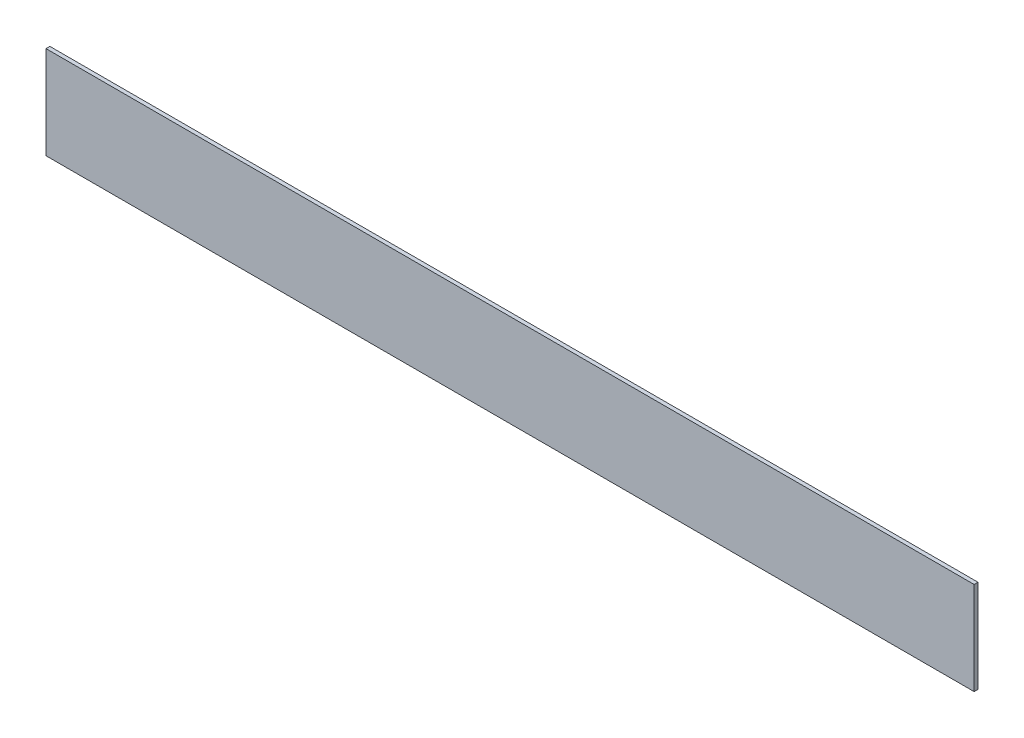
ISO-10303-21;
HEADER;
FILE_DESCRIPTION(('STEP AP214'),'2;1');
FILE_NAME('part.step','',(''),(''),'','','');
FILE_SCHEMA(('AUTOMOTIVE_DESIGN { 1 0 10303 214 1 1 1 1 }'));
ENDSEC;
DATA;
#1=APPLICATION_CONTEXT('core data for automotive mechanical design processes');
#2=APPLICATION_PROTOCOL_DEFINITION('international standard','automotive_design',2000,#1);
#3=PRODUCT_CONTEXT('',#1,'mechanical');
#4=PRODUCT('Part','Part','',(#3));
#5=PRODUCT_RELATED_PRODUCT_CATEGORY('part','',(#4));
#6=PRODUCT_DEFINITION_FORMATION('','',#4);
#7=PRODUCT_DEFINITION_CONTEXT('part definition',#1,'design');
#8=PRODUCT_DEFINITION('design','',#6,#7);
#9=PRODUCT_DEFINITION_SHAPE('','',#8);
#10=(LENGTH_UNIT() NAMED_UNIT(*) SI_UNIT(.MILLI.,.METRE.));
#11=(NAMED_UNIT(*) PLANE_ANGLE_UNIT() SI_UNIT($,.RADIAN.));
#12=(NAMED_UNIT(*) SI_UNIT($,.STERADIAN.) SOLID_ANGLE_UNIT());
#13=UNCERTAINTY_MEASURE_WITH_UNIT(LENGTH_MEASURE(1.E-05),#10,'distance_accuracy_value','');
#14=(GEOMETRIC_REPRESENTATION_CONTEXT(3) GLOBAL_UNCERTAINTY_ASSIGNED_CONTEXT((#13)) GLOBAL_UNIT_ASSIGNED_CONTEXT((#10,
#11,#12)) REPRESENTATION_CONTEXT('',''));
#15=CARTESIAN_POINT('',(0.,0.,0.));
#16=DIRECTION('',(0.,0.,1.));
#17=DIRECTION('',(1.,0.,0.));
#18=AXIS2_PLACEMENT_3D('',#15,#16,#17);
#19=CARTESIAN_POINT('',(-95.9040772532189,52.5714592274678,3.175));
#20=DIRECTION('',(1.,0.,0.));
#21=DIRECTION('',(0.,1.,0.));
#22=AXIS2_PLACEMENT_3D('',#19,#20,#21);
#23=PLANE('',#22);
#24=DIRECTION('',(0.,-1.,0.));
#25=VECTOR('',#24,1.);
#26=CARTESIAN_POINT('',(-95.9040772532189,52.5714592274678,0.));
#27=LINE('',#26,#25);
#28=CARTESIAN_POINT('',(-95.9040772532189,52.5714592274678,0.));
#29=VERTEX_POINT('',#28);
#30=CARTESIAN_POINT('',(-95.9040772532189,-23.6285407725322,0.));
#31=VERTEX_POINT('',#30);
#32=EDGE_CURVE('E75',#29,#31,#27,.T.);
#33=ORIENTED_EDGE('',*,*,#32,.T.);
#34=DIRECTION('',(0.,0.,-1.));
#35=VECTOR('',#34,1.);
#36=CARTESIAN_POINT('',(-95.9040772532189,-23.6285407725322,3.175));
#37=LINE('',#36,#35);
#38=CARTESIAN_POINT('',(-95.9040772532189,-23.6285407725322,3.175));
#39=VERTEX_POINT('',#38);
#40=EDGE_CURVE('E11',#39,#31,#37,.T.);
#41=ORIENTED_EDGE('',*,*,#40,.F.);
#42=DIRECTION('',(0.,-1.,0.));
#43=VECTOR('',#42,1.);
#44=CARTESIAN_POINT('',(-95.9040772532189,52.5714592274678,3.175));
#45=LINE('',#44,#43);
#46=CARTESIAN_POINT('',(-95.9040772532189,52.5714592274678,3.175));
#47=VERTEX_POINT('',#46);
#48=EDGE_CURVE('E93',#47,#39,#45,.T.);
#49=ORIENTED_EDGE('',*,*,#48,.F.);
#50=DIRECTION('',(0.,0.,-1.));
#51=VECTOR('',#50,1.);
#52=CARTESIAN_POINT('',(-95.9040772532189,52.5714592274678,3.175));
#53=LINE('',#52,#51);
#54=EDGE_CURVE('E87',#47,#29,#53,.T.);
#55=ORIENTED_EDGE('',*,*,#54,.T.);
#56=EDGE_LOOP('',(#33,#41,#49,#55));
#57=FACE_BOUND('',#56,.T.);
#58=ADVANCED_FACE('F31',(#57),#23,.F.);
#59=CARTESIAN_POINT('',(-95.9040772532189,-23.6285407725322,3.175));
#60=DIRECTION('',(0.,1.,0.));
#61=DIRECTION('',(0.,0.,1.));
#62=AXIS2_PLACEMENT_3D('',#59,#60,#61);
#63=PLANE('',#62);
#64=DIRECTION('',(1.,0.,0.));
#65=VECTOR('',#64,1.);
#66=CARTESIAN_POINT('',(-95.9040772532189,-23.6285407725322,0.));
#67=LINE('',#66,#65);
#68=CARTESIAN_POINT('',(666.095922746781,-23.6285407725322,0.));
#69=VERTEX_POINT('',#68);
#70=EDGE_CURVE('E71',#31,#69,#67,.T.);
#71=ORIENTED_EDGE('',*,*,#70,.T.);
#72=DIRECTION('',(0.,0.,-1.));
#73=VECTOR('',#72,1.);
#74=CARTESIAN_POINT('',(666.095922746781,-23.6285407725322,3.175));
#75=LINE('',#74,#73);
#76=CARTESIAN_POINT('',(666.095922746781,-23.6285407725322,3.175));
#77=VERTEX_POINT('',#76);
#78=EDGE_CURVE('E38',#77,#69,#75,.T.);
#79=ORIENTED_EDGE('',*,*,#78,.F.);
#80=DIRECTION('',(1.,0.,0.));
#81=VECTOR('',#80,1.);
#82=CARTESIAN_POINT('',(-95.9040772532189,-23.6285407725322,3.175));
#83=LINE('',#82,#81);
#84=EDGE_CURVE('E83',#39,#77,#83,.T.);
#85=ORIENTED_EDGE('',*,*,#84,.F.);
#86=ORIENTED_EDGE('',*,*,#40,.T.);
#87=EDGE_LOOP('',(#71,#79,#85,#86));
#88=FACE_BOUND('',#87,.T.);
#89=ADVANCED_FACE('F82',(#88),#63,.F.);
#90=CARTESIAN_POINT('',(666.095922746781,52.5714592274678,3.175));
#91=DIRECTION('',(-1.,0.,0.));
#92=DIRECTION('',(0.,0.,1.));
#93=AXIS2_PLACEMENT_3D('',#90,#91,#92);
#94=PLANE('',#93);
#95=DIRECTION('',(0.,1.,0.));
#96=VECTOR('',#95,1.);
#97=CARTESIAN_POINT('',(666.095922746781,52.5714592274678,0.));
#98=LINE('',#97,#96);
#99=CARTESIAN_POINT('',(666.095922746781,52.5714592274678,0.));
#100=VERTEX_POINT('',#99);
#101=EDGE_CURVE('E76',#69,#100,#98,.T.);
#102=ORIENTED_EDGE('',*,*,#101,.T.);
#103=DIRECTION('',(0.,0.,-1.));
#104=VECTOR('',#103,1.);
#105=CARTESIAN_POINT('',(666.095922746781,52.5714592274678,3.175));
#106=LINE('',#105,#104);
#107=CARTESIAN_POINT('',(666.095922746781,52.5714592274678,3.175));
#108=VERTEX_POINT('',#107);
#109=EDGE_CURVE('E99',#108,#100,#106,.T.);
#110=ORIENTED_EDGE('',*,*,#109,.F.);
#111=DIRECTION('',(0.,1.,0.));
#112=VECTOR('',#111,1.);
#113=CARTESIAN_POINT('',(666.095922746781,52.5714592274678,3.175));
#114=LINE('',#113,#112);
#115=EDGE_CURVE('E50',#77,#108,#114,.T.);
#116=ORIENTED_EDGE('',*,*,#115,.F.);
#117=ORIENTED_EDGE('',*,*,#78,.T.);
#118=EDGE_LOOP('',(#102,#110,#116,#117));
#119=FACE_BOUND('',#118,.T.);
#120=ADVANCED_FACE('F102',(#119),#94,.F.);
#121=CARTESIAN_POINT('',(-95.9040772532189,52.5714592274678,3.175));
#122=DIRECTION('',(0.,-1.,0.));
#123=DIRECTION('',(0.,0.,-1.));
#124=AXIS2_PLACEMENT_3D('',#121,#122,#123);
#125=PLANE('',#124);
#126=DIRECTION('',(-1.,0.,0.));
#127=VECTOR('',#126,1.);
#128=CARTESIAN_POINT('',(-95.9040772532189,52.5714592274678,0.));
#129=LINE('',#128,#127);
#130=EDGE_CURVE('E91',#100,#29,#129,.T.);
#131=ORIENTED_EDGE('',*,*,#130,.T.);
#132=ORIENTED_EDGE('',*,*,#54,.F.);
#133=DIRECTION('',(-1.,0.,0.));
#134=VECTOR('',#133,1.);
#135=CARTESIAN_POINT('',(-95.9040772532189,52.5714592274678,3.175));
#136=LINE('',#135,#134);
#137=EDGE_CURVE('E45',#108,#47,#136,.T.);
#138=ORIENTED_EDGE('',*,*,#137,.F.);
#139=ORIENTED_EDGE('',*,*,#109,.T.);
#140=EDGE_LOOP('',(#131,#132,#138,#139));
#141=FACE_BOUND('',#140,.T.);
#142=ADVANCED_FACE('F104',(#141),#125,.F.);
#143=CARTESIAN_POINT('',(-95.9040772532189,-23.6285407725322,3.175));
#144=DIRECTION('',(0.,0.,1.));
#145=DIRECTION('',(1.,0.,0.));
#146=AXIS2_PLACEMENT_3D('',#143,#144,#145);
#147=PLANE('',#146);
#148=ORIENTED_EDGE('',*,*,#48,.T.);
#149=ORIENTED_EDGE('',*,*,#84,.T.);
#150=ORIENTED_EDGE('',*,*,#115,.T.);
#151=ORIENTED_EDGE('',*,*,#137,.T.);
#152=EDGE_LOOP('',(#148,#149,#150,#151));
#153=FACE_BOUND('',#152,.T.);
#154=ADVANCED_FACE('F105',(#153),#147,.T.);
#155=CARTESIAN_POINT('',(-95.9040772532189,-23.6285407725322,0.));
#156=DIRECTION('',(0.,0.,1.));
#157=DIRECTION('',(1.,0.,0.));
#158=AXIS2_PLACEMENT_3D('',#155,#156,#157);
#159=PLANE('',#158);
#160=ORIENTED_EDGE('',*,*,#32,.F.);
#161=ORIENTED_EDGE('',*,*,#130,.F.);
#162=ORIENTED_EDGE('',*,*,#101,.F.);
#163=ORIENTED_EDGE('',*,*,#70,.F.);
#164=EDGE_LOOP('',(#160,#161,#162,#163));
#165=FACE_BOUND('',#164,.T.);
#166=ADVANCED_FACE('F72',(#165),#159,.F.);
#167=CLOSED_SHELL('',(#58,#89,#120,#142,#154,#166));
#168=MANIFOLD_SOLID_BREP('B2',#167);
#169=ADVANCED_BREP_SHAPE_REPRESENTATION('',(#18,#168),#14);
#170=SHAPE_DEFINITION_REPRESENTATION(#9,#169);
ENDSEC;
END-ISO-10303-21;
